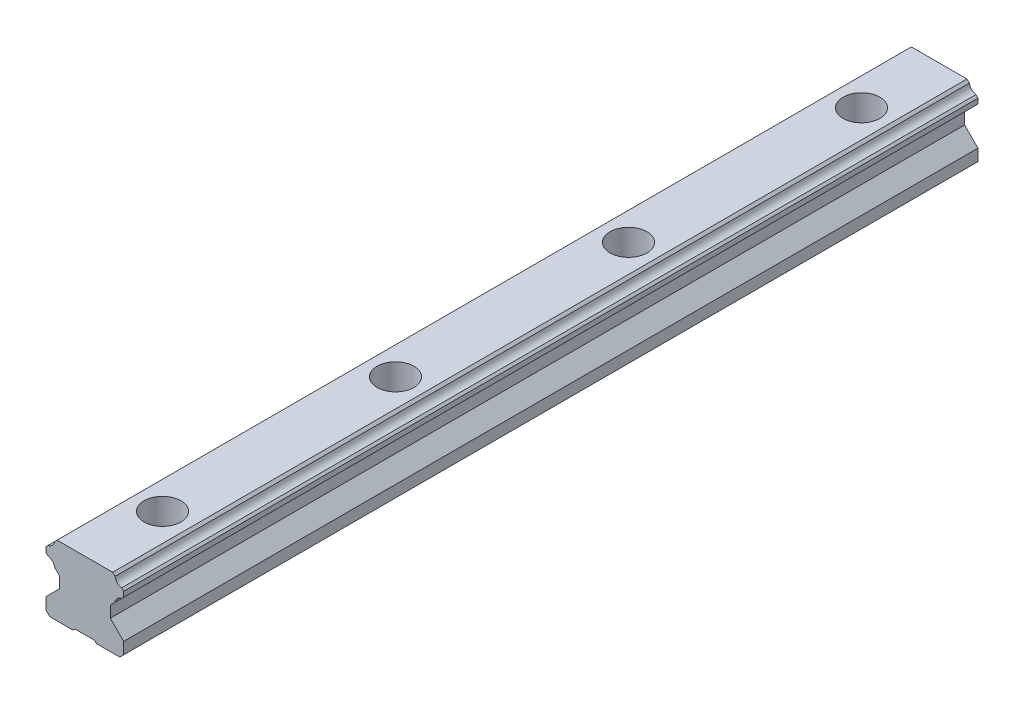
ISO-10303-21;
HEADER;
FILE_DESCRIPTION(('STEP AP214'),'2;1');
FILE_NAME('part.step','',(''),(''),'','','');
FILE_SCHEMA(('AUTOMOTIVE_DESIGN { 1 0 10303 214 1 1 1 1 }'));
ENDSEC;
DATA;
#1=APPLICATION_CONTEXT('core data for automotive mechanical design processes');
#2=APPLICATION_PROTOCOL_DEFINITION('international standard','automotive_design',2000,#1);
#3=PRODUCT_CONTEXT('',#1,'mechanical');
#4=PRODUCT('Part','Part','',(#3));
#5=PRODUCT_RELATED_PRODUCT_CATEGORY('part','',(#4));
#6=PRODUCT_DEFINITION_FORMATION('','',#4);
#7=PRODUCT_DEFINITION_CONTEXT('part definition',#1,'design');
#8=PRODUCT_DEFINITION('design','',#6,#7);
#9=PRODUCT_DEFINITION_SHAPE('','',#8);
#10=(LENGTH_UNIT() NAMED_UNIT(*) SI_UNIT(.MILLI.,.METRE.));
#11=(NAMED_UNIT(*) PLANE_ANGLE_UNIT() SI_UNIT($,.RADIAN.));
#12=(NAMED_UNIT(*) SI_UNIT($,.STERADIAN.) SOLID_ANGLE_UNIT());
#13=UNCERTAINTY_MEASURE_WITH_UNIT(LENGTH_MEASURE(1.E-05),#10,'distance_accuracy_value','');
#14=(GEOMETRIC_REPRESENTATION_CONTEXT(3) GLOBAL_UNCERTAINTY_ASSIGNED_CONTEXT((#13)) GLOBAL_UNIT_ASSIGNED_CONTEXT((#10,
#11,#12)) REPRESENTATION_CONTEXT('',''));
#15=CARTESIAN_POINT('',(0.,0.,0.));
#16=DIRECTION('',(0.,0.,1.));
#17=DIRECTION('',(1.,0.,0.));
#18=AXIS2_PLACEMENT_3D('',#15,#16,#17);
#19=CARTESIAN_POINT('',(-2.5,0.5,110.));
#20=DIRECTION('',(0.,1.,0.));
#21=DIRECTION('',(0.,0.,1.));
#22=AXIS2_PLACEMENT_3D('',#19,#20,#21);
#23=PLANE('',#22);
#24=DIRECTION('',(0.,0.,-1.));
#25=VECTOR('',#24,1.);
#26=CARTESIAN_POINT('',(2.5,0.5,110.));
#27=LINE('',#26,#25);
#28=CARTESIAN_POINT('',(2.5,0.5,-91.6583123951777));
#29=VERTEX_POINT('',#28);
#30=CARTESIAN_POINT('',(2.5,0.5,-110.));
#31=VERTEX_POINT('',#30);
#32=EDGE_CURVE('E327',#29,#31,#27,.T.);
#33=ORIENTED_EDGE('',*,*,#32,.F.);
#34=CARTESIAN_POINT('',(0.,0.5,-90.));
#35=DIRECTION('',(0.,1.,0.));
#36=DIRECTION('',(0.,0.,1.));
#37=AXIS2_PLACEMENT_3D('',#34,#35,#36);
#38=CIRCLE('',#37,3.);
#39=CARTESIAN_POINT('',(-2.5,0.5,-91.6583123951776));
#40=VERTEX_POINT('',#39);
#41=EDGE_CURVE('E295',#29,#40,#38,.T.);
#42=ORIENTED_EDGE('',*,*,#41,.T.);
#43=DIRECTION('',(0.,0.,-1.));
#44=VECTOR('',#43,1.);
#45=CARTESIAN_POINT('',(-2.5,0.5,110.));
#46=LINE('',#45,#44);
#47=CARTESIAN_POINT('',(-2.5,0.5,-110.));
#48=VERTEX_POINT('',#47);
#49=EDGE_CURVE('E332',#40,#48,#46,.T.);
#50=ORIENTED_EDGE('',*,*,#49,.T.);
#51=DIRECTION('',(1.,0.,0.));
#52=VECTOR('',#51,1.);
#53=CARTESIAN_POINT('',(-2.5,0.5,-110.));
#54=LINE('',#53,#52);
#55=EDGE_CURVE('E390',#48,#31,#54,.T.);
#56=ORIENTED_EDGE('',*,*,#55,.T.);
#57=EDGE_LOOP('',(#33,#42,#50,#56));
#58=FACE_BOUND('',#57,.T.);
#59=ADVANCED_FACE('F35',(#58),#23,.F.);
#60=CARTESIAN_POINT('',(-2.5,0.5,110.));
#61=DIRECTION('',(-0.707106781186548,0.707106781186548,0.));
#62=DIRECTION('',(-0.707106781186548,-0.707106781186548,0.));
#63=AXIS2_PLACEMENT_3D('',#60,#61,#62);
#64=PLANE('',#63);
#65=ORIENTED_EDGE('',*,*,#49,.F.);
#66=CARTESIAN_POINT('',(0.,3.,-90.));
#67=DIRECTION('',(-0.707106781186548,0.707106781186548,0.));
#68=DIRECTION('',(0.707106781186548,0.707106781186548,0.));
#69=AXIS2_PLACEMENT_3D('',#66,#67,#68);
#70=ELLIPSE('',#69,4.24264068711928,3.);
#71=CARTESIAN_POINT('',(-3.,0.,-90.));
#72=VERTEX_POINT('',#71);
#73=EDGE_CURVE('E11',#40,#72,#70,.T.);
#74=ORIENTED_EDGE('',*,*,#73,.T.);
#75=DIRECTION('',(0.,0.,-1.));
#76=VECTOR('',#75,1.);
#77=CARTESIAN_POINT('',(-3.,0.,110.));
#78=LINE('',#77,#76);
#79=CARTESIAN_POINT('',(-3.,0.,-110.));
#80=VERTEX_POINT('',#79);
#81=EDGE_CURVE('E337',#72,#80,#78,.T.);
#82=ORIENTED_EDGE('',*,*,#81,.T.);
#83=DIRECTION('',(0.707106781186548,0.707106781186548,0.));
#84=VECTOR('',#83,1.);
#85=CARTESIAN_POINT('',(-2.5,0.5,-110.));
#86=LINE('',#85,#84);
#87=EDGE_CURVE('E393',#80,#48,#86,.T.);
#88=ORIENTED_EDGE('',*,*,#87,.T.);
#89=EDGE_LOOP('',(#65,#74,#82,#88));
#90=FACE_BOUND('',#89,.T.);
#91=ADVANCED_FACE('F394',(#90),#64,.F.);
#92=CARTESIAN_POINT('',(3.,0.,110.));
#93=DIRECTION('',(0.707106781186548,0.707106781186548,0.));
#94=DIRECTION('',(-0.707106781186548,0.707106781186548,0.));
#95=AXIS2_PLACEMENT_3D('',#92,#93,#94);
#96=PLANE('',#95);
#97=CARTESIAN_POINT('',(2.5,0.5,-31.6583123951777));
#98=VERTEX_POINT('',#97);
#99=CARTESIAN_POINT('',(2.5,0.5,-88.3416876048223));
#100=VERTEX_POINT('',#99);
#101=EDGE_CURVE('E308',#98,#100,#27,.T.);
#102=ORIENTED_EDGE('',*,*,#101,.T.);
#103=CARTESIAN_POINT('',(0.,3.,-90.));
#104=DIRECTION('',(0.707106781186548,0.707106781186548,0.));
#105=DIRECTION('',(-0.707106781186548,0.707106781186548,0.));
#106=AXIS2_PLACEMENT_3D('',#103,#104,#105);
#107=ELLIPSE('',#106,4.24264068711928,3.);
#108=CARTESIAN_POINT('',(3.,0.,-90.));
#109=VERTEX_POINT('',#108);
#110=EDGE_CURVE('E293',#100,#109,#107,.T.);
#111=ORIENTED_EDGE('',*,*,#110,.T.);
#112=DIRECTION('',(0.,0.,-1.));
#113=VECTOR('',#112,1.);
#114=CARTESIAN_POINT('',(3.,0.,110.));
#115=LINE('',#114,#113);
#116=CARTESIAN_POINT('',(3.,0.,-30.));
#117=VERTEX_POINT('',#116);
#118=EDGE_CURVE('E305',#117,#109,#115,.T.);
#119=ORIENTED_EDGE('',*,*,#118,.F.);
#120=CARTESIAN_POINT('',(0.,3.,-30.));
#121=DIRECTION('',(0.707106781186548,0.707106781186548,0.));
#122=DIRECTION('',(-0.707106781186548,0.707106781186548,0.));
#123=AXIS2_PLACEMENT_3D('',#120,#121,#122);
#124=ELLIPSE('',#123,4.24264068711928,3.);
#125=EDGE_CURVE('E720',#117,#98,#124,.T.);
#126=ORIENTED_EDGE('',*,*,#125,.T.);
#127=EDGE_LOOP('',(#102,#111,#119,#126));
#128=FACE_BOUND('',#127,.T.);
#129=ADVANCED_FACE('F303',(#128),#96,.F.);
#130=CARTESIAN_POINT('',(-2.5,0.5,-31.6583123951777));
#131=VERTEX_POINT('',#130);
#132=CARTESIAN_POINT('',(-2.5,0.5,-88.3416876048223));
#133=VERTEX_POINT('',#132);
#134=EDGE_CURVE('E381',#131,#133,#46,.T.);
#135=ORIENTED_EDGE('',*,*,#134,.T.);
#136=EDGE_CURVE('E50',#133,#100,#38,.T.);
#137=ORIENTED_EDGE('',*,*,#136,.T.);
#138=ORIENTED_EDGE('',*,*,#101,.F.);
#139=CARTESIAN_POINT('',(0.,0.5,-30.));
#140=DIRECTION('',(0.,1.,0.));
#141=DIRECTION('',(0.,0.,1.));
#142=AXIS2_PLACEMENT_3D('',#139,#140,#141);
#143=CIRCLE('',#142,3.);
#144=EDGE_CURVE('E58',#98,#131,#143,.T.);
#145=ORIENTED_EDGE('',*,*,#144,.T.);
#146=EDGE_LOOP('',(#135,#137,#138,#145));
#147=FACE_BOUND('',#146,.T.);
#148=ADVANCED_FACE('F775',(#147),#23,.F.);
#149=CARTESIAN_POINT('',(-3.,0.,-30.));
#150=VERTEX_POINT('',#149);
#151=EDGE_CURVE('E1243',#150,#72,#78,.T.);
#152=ORIENTED_EDGE('',*,*,#151,.T.);
#153=EDGE_CURVE('E39',#72,#133,#70,.T.);
#154=ORIENTED_EDGE('',*,*,#153,.T.);
#155=ORIENTED_EDGE('',*,*,#134,.F.);
#156=CARTESIAN_POINT('',(0.,3.,-30.));
#157=DIRECTION('',(-0.707106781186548,0.707106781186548,0.));
#158=DIRECTION('',(0.707106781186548,0.707106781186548,0.));
#159=AXIS2_PLACEMENT_3D('',#156,#157,#158);
#160=ELLIPSE('',#159,4.24264068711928,3.);
#161=EDGE_CURVE('E728',#131,#150,#160,.T.);
#162=ORIENTED_EDGE('',*,*,#161,.T.);
#163=EDGE_LOOP('',(#152,#154,#155,#162));
#164=FACE_BOUND('',#163,.T.);
#165=ADVANCED_FACE('F786',(#164),#64,.F.);
#166=CARTESIAN_POINT('',(2.5,0.5,28.3416876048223));
#167=VERTEX_POINT('',#166);
#168=CARTESIAN_POINT('',(2.5,0.5,-28.3416876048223));
#169=VERTEX_POINT('',#168);
#170=EDGE_CURVE('E370',#167,#169,#27,.T.);
#171=ORIENTED_EDGE('',*,*,#170,.T.);
#172=EDGE_CURVE('E718',#169,#117,#124,.T.);
#173=ORIENTED_EDGE('',*,*,#172,.T.);
#174=CARTESIAN_POINT('',(3.,0.,30.));
#175=VERTEX_POINT('',#174);
#176=EDGE_CURVE('E322',#175,#117,#115,.T.);
#177=ORIENTED_EDGE('',*,*,#176,.F.);
#178=CARTESIAN_POINT('',(0.,3.,30.));
#179=DIRECTION('',(0.707106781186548,0.707106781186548,0.));
#180=DIRECTION('',(-0.707106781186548,0.707106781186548,0.));
#181=AXIS2_PLACEMENT_3D('',#178,#179,#180);
#182=ELLIPSE('',#181,4.24264068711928,3.);
#183=EDGE_CURVE('E714',#175,#167,#182,.T.);
#184=ORIENTED_EDGE('',*,*,#183,.T.);
#185=EDGE_LOOP('',(#171,#173,#177,#184));
#186=FACE_BOUND('',#185,.T.);
#187=ADVANCED_FACE('F717',(#186),#96,.F.);
#188=CARTESIAN_POINT('',(-3.,0.,30.));
#189=VERTEX_POINT('',#188);
#190=EDGE_CURVE('E761',#189,#150,#78,.T.);
#191=ORIENTED_EDGE('',*,*,#190,.T.);
#192=CARTESIAN_POINT('',(-2.5,0.5,-28.3416876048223));
#193=VERTEX_POINT('',#192);
#194=EDGE_CURVE('E380',#150,#193,#160,.T.);
#195=ORIENTED_EDGE('',*,*,#194,.T.);
#196=CARTESIAN_POINT('',(-2.5,0.5,28.3416876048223));
#197=VERTEX_POINT('',#196);
#198=EDGE_CURVE('E368',#197,#193,#46,.T.);
#199=ORIENTED_EDGE('',*,*,#198,.F.);
#200=CARTESIAN_POINT('',(0.,3.,30.));
#201=DIRECTION('',(-0.707106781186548,0.707106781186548,0.));
#202=DIRECTION('',(0.707106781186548,0.707106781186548,0.));
#203=AXIS2_PLACEMENT_3D('',#200,#201,#202);
#204=ELLIPSE('',#203,4.24264068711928,3.);
#205=EDGE_CURVE('E378',#197,#189,#204,.T.);
#206=ORIENTED_EDGE('',*,*,#205,.T.);
#207=EDGE_LOOP('',(#191,#195,#199,#206));
#208=FACE_BOUND('',#207,.T.);
#209=ADVANCED_FACE('F377',(#208),#64,.F.);
#210=CARTESIAN_POINT('',(2.5,0.5,88.3416876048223));
#211=VERTEX_POINT('',#210);
#212=CARTESIAN_POINT('',(2.5,0.5,31.6583123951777));
#213=VERTEX_POINT('',#212);
#214=EDGE_CURVE('E333',#211,#213,#27,.T.);
#215=ORIENTED_EDGE('',*,*,#214,.T.);
#216=EDGE_CURVE('E710',#213,#175,#182,.T.);
#217=ORIENTED_EDGE('',*,*,#216,.T.);
#218=CARTESIAN_POINT('',(3.,0.,90.));
#219=VERTEX_POINT('',#218);
#220=EDGE_CURVE('E323',#219,#175,#115,.T.);
#221=ORIENTED_EDGE('',*,*,#220,.F.);
#222=CARTESIAN_POINT('',(0.,3.,90.));
#223=DIRECTION('',(0.707106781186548,0.707106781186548,0.));
#224=DIRECTION('',(-0.707106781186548,0.707106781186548,0.));
#225=AXIS2_PLACEMENT_3D('',#222,#223,#224);
#226=ELLIPSE('',#225,4.24264068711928,3.);
#227=EDGE_CURVE('E704',#219,#211,#226,.T.);
#228=ORIENTED_EDGE('',*,*,#227,.T.);
#229=EDGE_LOOP('',(#215,#217,#221,#228));
#230=FACE_BOUND('',#229,.T.);
#231=ADVANCED_FACE('F709',(#230),#96,.F.);
#232=ORIENTED_EDGE('',*,*,#198,.T.);
#233=EDGE_CURVE('E719',#193,#169,#143,.T.);
#234=ORIENTED_EDGE('',*,*,#233,.T.);
#235=ORIENTED_EDGE('',*,*,#170,.F.);
#236=CARTESIAN_POINT('',(0.,0.5,30.));
#237=DIRECTION('',(0.,1.,0.));
#238=DIRECTION('',(0.,0.,1.));
#239=AXIS2_PLACEMENT_3D('',#236,#237,#238);
#240=CIRCLE('',#239,3.);
#241=EDGE_CURVE('E299',#167,#197,#240,.T.);
#242=ORIENTED_EDGE('',*,*,#241,.T.);
#243=EDGE_LOOP('',(#232,#234,#235,#242));
#244=FACE_BOUND('',#243,.T.);
#245=ADVANCED_FACE('F366',(#244),#23,.F.);
#246=CARTESIAN_POINT('',(-3.,0.,90.));
#247=VERTEX_POINT('',#246);
#248=EDGE_CURVE('E343',#247,#189,#78,.T.);
#249=ORIENTED_EDGE('',*,*,#248,.T.);
#250=CARTESIAN_POINT('',(-2.5,0.5,31.6583123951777));
#251=VERTEX_POINT('',#250);
#252=EDGE_CURVE('E711',#189,#251,#204,.T.);
#253=ORIENTED_EDGE('',*,*,#252,.T.);
#254=CARTESIAN_POINT('',(-2.5,0.5,88.3416876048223));
#255=VERTEX_POINT('',#254);
#256=EDGE_CURVE('E338',#255,#251,#46,.T.);
#257=ORIENTED_EDGE('',*,*,#256,.F.);
#258=CARTESIAN_POINT('',(0.,3.,90.));
#259=DIRECTION('',(-0.707106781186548,0.707106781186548,0.));
#260=DIRECTION('',(0.707106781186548,0.707106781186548,0.));
#261=AXIS2_PLACEMENT_3D('',#258,#259,#260);
#262=ELLIPSE('',#261,4.24264068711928,3.);
#263=EDGE_CURVE('E567',#255,#247,#262,.T.);
#264=ORIENTED_EDGE('',*,*,#263,.T.);
#265=EDGE_LOOP('',(#249,#253,#257,#264));
#266=FACE_BOUND('',#265,.T.);
#267=ADVANCED_FACE('F758',(#266),#64,.F.);
#268=ORIENTED_EDGE('',*,*,#256,.T.);
#269=EDGE_CURVE('E355',#251,#213,#240,.T.);
#270=ORIENTED_EDGE('',*,*,#269,.T.);
#271=ORIENTED_EDGE('',*,*,#214,.F.);
#272=CARTESIAN_POINT('',(0.,0.5,90.));
#273=DIRECTION('',(0.,1.,0.));
#274=DIRECTION('',(0.,0.,1.));
#275=AXIS2_PLACEMENT_3D('',#272,#273,#274);
#276=CIRCLE('',#275,3.);
#277=EDGE_CURVE('E747',#211,#255,#276,.T.);
#278=ORIENTED_EDGE('',*,*,#277,.T.);
#279=EDGE_LOOP('',(#268,#270,#271,#278));
#280=FACE_BOUND('',#279,.T.);
#281=ADVANCED_FACE('F767',(#280),#23,.F.);
#282=CARTESIAN_POINT('',(2.5,0.5,110.));
#283=VERTEX_POINT('',#282);
#284=CARTESIAN_POINT('',(2.5,0.5,91.6583123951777));
#285=VERTEX_POINT('',#284);
#286=EDGE_CURVE('E329',#283,#285,#27,.T.);
#287=ORIENTED_EDGE('',*,*,#286,.T.);
#288=EDGE_CURVE('E699',#285,#219,#226,.T.);
#289=ORIENTED_EDGE('',*,*,#288,.T.);
#290=CARTESIAN_POINT('',(3.,0.,110.));
#291=VERTEX_POINT('',#290);
#292=EDGE_CURVE('E318',#291,#219,#115,.T.);
#293=ORIENTED_EDGE('',*,*,#292,.F.);
#294=DIRECTION('',(0.707106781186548,-0.707106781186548,0.));
#295=VECTOR('',#294,1.);
#296=CARTESIAN_POINT('',(3.,0.,110.));
#297=LINE('',#296,#295);
#298=EDGE_CURVE('E690',#283,#291,#297,.T.);
#299=ORIENTED_EDGE('',*,*,#298,.F.);
#300=EDGE_LOOP('',(#287,#289,#293,#299));
#301=FACE_BOUND('',#300,.T.);
#302=ADVANCED_FACE('F698',(#301),#96,.F.);
#303=CARTESIAN_POINT('',(-6.5500488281,10.3792352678,110.));
#304=DIRECTION('',(1.,0.,0.));
#305=DIRECTION('',(0.,0.,-1.));
#306=AXIS2_PLACEMENT_3D('',#303,#304,#305);
#307=PLANE('',#306);
#308=DIRECTION('',(0.,-1.,0.));
#309=VECTOR('',#308,1.);
#310=CARTESIAN_POINT('',(-6.5500488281,10.3792352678,-110.));
#311=LINE('',#310,#309);
#312=CARTESIAN_POINT('',(-6.5500488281,10.3792352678,-110.));
#313=VERTEX_POINT('',#312);
#314=CARTESIAN_POINT('',(-6.5500488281,7.4499511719,-110.));
#315=VERTEX_POINT('',#314);
#316=EDGE_CURVE('E563',#313,#315,#311,.T.);
#317=ORIENTED_EDGE('',*,*,#316,.T.);
#318=DIRECTION('',(0.,0.,-1.));
#319=VECTOR('',#318,1.);
#320=CARTESIAN_POINT('',(-6.5500488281,7.4499511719,110.));
#321=LINE('',#320,#319);
#322=CARTESIAN_POINT('',(-6.5500488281,7.4499511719,110.));
#323=VERTEX_POINT('',#322);
#324=EDGE_CURVE('E352',#323,#315,#321,.T.);
#325=ORIENTED_EDGE('',*,*,#324,.F.);
#326=DIRECTION('',(0.,-1.,0.));
#327=VECTOR('',#326,1.);
#328=CARTESIAN_POINT('',(-6.5500488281,10.3792352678,110.));
#329=LINE('',#328,#327);
#330=CARTESIAN_POINT('',(-6.5500488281,10.3792352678,110.));
#331=VERTEX_POINT('',#330);
#332=EDGE_CURVE('E447',#331,#323,#329,.T.);
#333=ORIENTED_EDGE('',*,*,#332,.F.);
#334=DIRECTION('',(0.,0.,-1.));
#335=VECTOR('',#334,1.);
#336=CARTESIAN_POINT('',(-6.5500488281,10.3792352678,110.));
#337=LINE('',#336,#335);
#338=EDGE_CURVE('E448',#331,#313,#337,.T.);
#339=ORIENTED_EDGE('',*,*,#338,.T.);
#340=EDGE_LOOP('',(#317,#325,#333,#339));
#341=FACE_BOUND('',#340,.T.);
#342=ADVANCED_FACE('F37',(#341),#307,.F.);
#343=CARTESIAN_POINT('',(-6.5500488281,7.4499511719,110.));
#344=DIRECTION('',(0.707098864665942,-0.707114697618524,0.));
#345=DIRECTION('',(0.707114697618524,0.707098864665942,0.));
#346=AXIS2_PLACEMENT_3D('',#343,#344,#345);
#347=PLANE('',#346);
#348=DIRECTION('',(-0.707114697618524,-0.707098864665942,0.));
#349=VECTOR('',#348,1.);
#350=CARTESIAN_POINT('',(-6.5500488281,7.4499511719,-110.));
#351=LINE('',#350,#349);
#352=CARTESIAN_POINT('',(-10.,4.0000772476,-110.));
#353=VERTEX_POINT('',#352);
#354=EDGE_CURVE('E566',#315,#353,#351,.T.);
#355=ORIENTED_EDGE('',*,*,#354,.T.);
#356=DIRECTION('',(0.,0.,-1.));
#357=VECTOR('',#356,1.);
#358=CARTESIAN_POINT('',(-10.,4.0000772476,110.));
#359=LINE('',#358,#357);
#360=CARTESIAN_POINT('',(-10.,4.0000772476,110.));
#361=VERTEX_POINT('',#360);
#362=EDGE_CURVE('E349',#361,#353,#359,.T.);
#363=ORIENTED_EDGE('',*,*,#362,.F.);
#364=DIRECTION('',(-0.707114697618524,-0.707098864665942,0.));
#365=VECTOR('',#364,1.);
#366=CARTESIAN_POINT('',(-6.5500488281,7.4499511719,110.));
#367=LINE('',#366,#365);
#368=EDGE_CURVE('E592',#323,#361,#367,.T.);
#369=ORIENTED_EDGE('',*,*,#368,.F.);
#370=ORIENTED_EDGE('',*,*,#324,.T.);
#371=EDGE_LOOP('',(#355,#363,#369,#370));
#372=FACE_BOUND('',#371,.T.);
#373=ADVANCED_FACE('F591',(#372),#347,.F.);
#374=CARTESIAN_POINT('',(-10.,4.0000772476,110.));
#375=DIRECTION('',(1.,0.,0.));
#376=DIRECTION('',(0.,0.,-1.));
#377=AXIS2_PLACEMENT_3D('',#374,#375,#376);
#378=PLANE('',#377);
#379=DIRECTION('',(0.,-1.,0.));
#380=VECTOR('',#379,1.);
#381=CARTESIAN_POINT('',(-10.,4.0000772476,-110.));
#382=LINE('',#381,#380);
#383=CARTESIAN_POINT('',(-10.,1.,-110.));
#384=VERTEX_POINT('',#383);
#385=EDGE_CURVE('E569',#353,#384,#382,.T.);
#386=ORIENTED_EDGE('',*,*,#385,.T.);
#387=DIRECTION('',(0.,0.,-1.));
#388=VECTOR('',#387,1.);
#389=CARTESIAN_POINT('',(-10.,1.,110.));
#390=LINE('',#389,#388);
#391=CARTESIAN_POINT('',(-10.,1.,110.));
#392=VERTEX_POINT('',#391);
#393=EDGE_CURVE('E346',#392,#384,#390,.T.);
#394=ORIENTED_EDGE('',*,*,#393,.F.);
#395=DIRECTION('',(0.,-1.,0.));
#396=VECTOR('',#395,1.);
#397=CARTESIAN_POINT('',(-10.,4.0000772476,110.));
#398=LINE('',#397,#396);
#399=EDGE_CURVE('E588',#361,#392,#398,.T.);
#400=ORIENTED_EDGE('',*,*,#399,.F.);
#401=ORIENTED_EDGE('',*,*,#362,.T.);
#402=EDGE_LOOP('',(#386,#394,#400,#401));
#403=FACE_BOUND('',#402,.T.);
#404=ADVANCED_FACE('F587',(#403),#378,.F.);
#405=CARTESIAN_POINT('',(-9.,0.,110.));
#406=DIRECTION('',(0.707106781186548,0.707106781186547,0.));
#407=DIRECTION('',(-0.707106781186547,0.707106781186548,0.));
#408=AXIS2_PLACEMENT_3D('',#405,#406,#407);
#409=PLANE('',#408);
#410=DIRECTION('',(0.707106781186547,-0.707106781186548,0.));
#411=VECTOR('',#410,1.);
#412=CARTESIAN_POINT('',(-9.,0.,-110.));
#413=LINE('',#412,#411);
#414=CARTESIAN_POINT('',(-9.,0.,-110.));
#415=VERTEX_POINT('',#414);
#416=EDGE_CURVE('E571',#384,#415,#413,.T.);
#417=ORIENTED_EDGE('',*,*,#416,.T.);
#418=DIRECTION('',(0.,0.,-1.));
#419=VECTOR('',#418,1.);
#420=CARTESIAN_POINT('',(-9.,0.,110.));
#421=LINE('',#420,#419);
#422=CARTESIAN_POINT('',(-9.,0.,110.));
#423=VERTEX_POINT('',#422);
#424=EDGE_CURVE('E342',#423,#415,#421,.T.);
#425=ORIENTED_EDGE('',*,*,#424,.F.);
#426=DIRECTION('',(0.707106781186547,-0.707106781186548,0.));
#427=VECTOR('',#426,1.);
#428=CARTESIAN_POINT('',(-9.,0.,110.));
#429=LINE('',#428,#427);
#430=EDGE_CURVE('E584',#392,#423,#429,.T.);
#431=ORIENTED_EDGE('',*,*,#430,.F.);
#432=ORIENTED_EDGE('',*,*,#393,.T.);
#433=EDGE_LOOP('',(#417,#425,#431,#432));
#434=FACE_BOUND('',#433,.T.);
#435=ADVANCED_FACE('F581',(#434),#409,.F.);
#436=CARTESIAN_POINT('',(-9.,0.,110.));
#437=DIRECTION('',(0.,1.,0.));
#438=DIRECTION('',(0.,0.,1.));
#439=AXIS2_PLACEMENT_3D('',#436,#437,#438);
#440=PLANE('',#439);
#441=DIRECTION('',(1.,0.,0.));
#442=VECTOR('',#441,1.);
#443=CARTESIAN_POINT('',(-9.,0.,-110.));
#444=LINE('',#443,#442);
#445=EDGE_CURVE('E399',#415,#80,#444,.T.);
#446=ORIENTED_EDGE('',*,*,#445,.T.);
#447=ORIENTED_EDGE('',*,*,#81,.F.);
#448=ORIENTED_EDGE('',*,*,#151,.F.);
#449=ORIENTED_EDGE('',*,*,#190,.F.);
#450=ORIENTED_EDGE('',*,*,#248,.F.);
#451=CARTESIAN_POINT('',(-3.,0.,110.));
#452=VERTEX_POINT('',#451);
#453=EDGE_CURVE('E339',#452,#247,#78,.T.);
#454=ORIENTED_EDGE('',*,*,#453,.F.);
#455=DIRECTION('',(1.,0.,0.));
#456=VECTOR('',#455,1.);
#457=CARTESIAN_POINT('',(-9.,0.,110.));
#458=LINE('',#457,#456);
#459=EDGE_CURVE('E684',#423,#452,#458,.T.);
#460=ORIENTED_EDGE('',*,*,#459,.F.);
#461=ORIENTED_EDGE('',*,*,#424,.T.);
#462=EDGE_LOOP('',(#446,#447,#448,#449,#450,#454,#460,#461));
#463=FACE_BOUND('',#462,.T.);
#464=ADVANCED_FACE('F573',(#463),#440,.F.);
#465=ORIENTED_EDGE('',*,*,#453,.T.);
#466=CARTESIAN_POINT('',(-2.5,0.5,91.6583123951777));
#467=VERTEX_POINT('',#466);
#468=EDGE_CURVE('E679',#247,#467,#262,.T.);
#469=ORIENTED_EDGE('',*,*,#468,.T.);
#470=CARTESIAN_POINT('',(-2.5,0.5,110.));
#471=VERTEX_POINT('',#470);
#472=EDGE_CURVE('E334',#471,#467,#46,.T.);
#473=ORIENTED_EDGE('',*,*,#472,.F.);
#474=DIRECTION('',(0.707106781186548,0.707106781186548,0.));
#475=VECTOR('',#474,1.);
#476=CARTESIAN_POINT('',(-2.5,0.5,110.));
#477=LINE('',#476,#475);
#478=EDGE_CURVE('E686',#452,#471,#477,.T.);
#479=ORIENTED_EDGE('',*,*,#478,.F.);
#480=EDGE_LOOP('',(#465,#469,#473,#479));
#481=FACE_BOUND('',#480,.T.);
#482=ADVANCED_FACE('F762',(#481),#64,.F.);
#483=ORIENTED_EDGE('',*,*,#472,.T.);
#484=EDGE_CURVE('E703',#467,#285,#276,.T.);
#485=ORIENTED_EDGE('',*,*,#484,.T.);
#486=ORIENTED_EDGE('',*,*,#286,.F.);
#487=DIRECTION('',(1.,0.,0.));
#488=VECTOR('',#487,1.);
#489=CARTESIAN_POINT('',(-2.5,0.5,110.));
#490=LINE('',#489,#488);
#491=EDGE_CURVE('E688',#471,#283,#490,.T.);
#492=ORIENTED_EDGE('',*,*,#491,.F.);
#493=EDGE_LOOP('',(#483,#485,#486,#492));
#494=FACE_BOUND('',#493,.T.);
#495=ADVANCED_FACE('F764',(#494),#23,.F.);
#496=CARTESIAN_POINT('',(3.,0.,-110.));
#497=VERTEX_POINT('',#496);
#498=EDGE_CURVE('E310',#109,#497,#115,.T.);
#499=ORIENTED_EDGE('',*,*,#498,.F.);
#500=EDGE_CURVE('E290',#109,#29,#107,.T.);
#501=ORIENTED_EDGE('',*,*,#500,.T.);
#502=ORIENTED_EDGE('',*,*,#32,.T.);
#503=DIRECTION('',(0.707106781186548,-0.707106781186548,0.));
#504=VECTOR('',#503,1.);
#505=CARTESIAN_POINT('',(3.,0.,-110.));
#506=LINE('',#505,#504);
#507=EDGE_CURVE('E313',#31,#497,#506,.T.);
#508=ORIENTED_EDGE('',*,*,#507,.T.);
#509=EDGE_LOOP('',(#499,#501,#502,#508));
#510=FACE_BOUND('',#509,.T.);
#511=ADVANCED_FACE('F311',(#510),#96,.F.);
#512=CARTESIAN_POINT('',(3.,0.,110.));
#513=DIRECTION('',(0.,1.,0.));
#514=DIRECTION('',(0.,0.,1.));
#515=AXIS2_PLACEMENT_3D('',#512,#513,#514);
#516=PLANE('',#515);
#517=DIRECTION('',(1.,0.,0.));
#518=VECTOR('',#517,1.);
#519=CARTESIAN_POINT('',(3.,0.,-110.));
#520=LINE('',#519,#518);
#521=CARTESIAN_POINT('',(9.,0.,-110.));
#522=VERTEX_POINT('',#521);
#523=EDGE_CURVE('E404',#497,#522,#520,.T.);
#524=ORIENTED_EDGE('',*,*,#523,.T.);
#525=DIRECTION('',(0.,0.,-1.));
#526=VECTOR('',#525,1.);
#527=CARTESIAN_POINT('',(9.,0.,110.));
#528=LINE('',#527,#526);
#529=CARTESIAN_POINT('',(9.,0.,110.));
#530=VERTEX_POINT('',#529);
#531=EDGE_CURVE('E316',#530,#522,#528,.T.);
#532=ORIENTED_EDGE('',*,*,#531,.F.);
#533=DIRECTION('',(1.,0.,0.));
#534=VECTOR('',#533,1.);
#535=CARTESIAN_POINT('',(3.,0.,110.));
#536=LINE('',#535,#534);
#537=EDGE_CURVE('E692',#291,#530,#536,.T.);
#538=ORIENTED_EDGE('',*,*,#537,.F.);
#539=ORIENTED_EDGE('',*,*,#292,.T.);
#540=ORIENTED_EDGE('',*,*,#220,.T.);
#541=ORIENTED_EDGE('',*,*,#176,.T.);
#542=ORIENTED_EDGE('',*,*,#118,.T.);
#543=ORIENTED_EDGE('',*,*,#498,.T.);
#544=EDGE_LOOP('',(#524,#532,#538,#539,#540,#541,#542,#543));
#545=FACE_BOUND('',#544,.T.);
#546=ADVANCED_FACE('F319',(#545),#516,.F.);
#547=CARTESIAN_POINT('',(10.,1.,110.));
#548=DIRECTION('',(-0.707106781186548,0.707106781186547,0.));
#549=DIRECTION('',(-0.707106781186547,-0.707106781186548,0.));
#550=AXIS2_PLACEMENT_3D('',#547,#548,#549);
#551=PLANE('',#550);
#552=DIRECTION('',(0.707106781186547,0.707106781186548,0.));
#553=VECTOR('',#552,1.);
#554=CARTESIAN_POINT('',(10.,1.,-110.));
#555=LINE('',#554,#553);
#556=CARTESIAN_POINT('',(10.,1.,-110.));
#557=VERTEX_POINT('',#556);
#558=EDGE_CURVE('E409',#522,#557,#555,.T.);
#559=ORIENTED_EDGE('',*,*,#558,.T.);
#560=DIRECTION('',(0.,0.,-1.));
#561=VECTOR('',#560,1.);
#562=CARTESIAN_POINT('',(10.,1.,110.));
#563=LINE('',#562,#561);
#564=CARTESIAN_POINT('',(10.,1.,110.));
#565=VERTEX_POINT('',#564);
#566=EDGE_CURVE('E502',#565,#557,#563,.T.);
#567=ORIENTED_EDGE('',*,*,#566,.F.);
#568=DIRECTION('',(0.707106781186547,0.707106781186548,0.));
#569=VECTOR('',#568,1.);
#570=CARTESIAN_POINT('',(10.,1.,110.));
#571=LINE('',#570,#569);
#572=EDGE_CURVE('E514',#530,#565,#571,.T.);
#573=ORIENTED_EDGE('',*,*,#572,.F.);
#574=ORIENTED_EDGE('',*,*,#531,.T.);
#575=EDGE_LOOP('',(#559,#567,#573,#574));
#576=FACE_BOUND('',#575,.T.);
#577=ADVANCED_FACE('F513',(#576),#551,.F.);
#578=CARTESIAN_POINT('',(10.,1.,110.));
#579=DIRECTION('',(-1.,0.,0.));
#580=DIRECTION('',(0.,0.,1.));
#581=AXIS2_PLACEMENT_3D('',#578,#579,#580);
#582=PLANE('',#581);
#583=DIRECTION('',(0.,1.,0.));
#584=VECTOR('',#583,1.);
#585=CARTESIAN_POINT('',(10.,1.,-110.));
#586=LINE('',#585,#584);
#587=CARTESIAN_POINT('',(10.,4.0000772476,-110.));
#588=VERTEX_POINT('',#587);
#589=EDGE_CURVE('E411',#557,#588,#586,.T.);
#590=ORIENTED_EDGE('',*,*,#589,.T.);
#591=DIRECTION('',(0.,0.,-1.));
#592=VECTOR('',#591,1.);
#593=CARTESIAN_POINT('',(10.,4.0000772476,110.));
#594=LINE('',#593,#592);
#595=CARTESIAN_POINT('',(10.,4.0000772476,110.));
#596=VERTEX_POINT('',#595);
#597=EDGE_CURVE('E500',#596,#588,#594,.T.);
#598=ORIENTED_EDGE('',*,*,#597,.F.);
#599=DIRECTION('',(0.,1.,0.));
#600=VECTOR('',#599,1.);
#601=CARTESIAN_POINT('',(10.,1.,110.));
#602=LINE('',#601,#600);
#603=EDGE_CURVE('E528',#565,#596,#602,.T.);
#604=ORIENTED_EDGE('',*,*,#603,.F.);
#605=ORIENTED_EDGE('',*,*,#566,.T.);
#606=EDGE_LOOP('',(#590,#598,#604,#605));
#607=FACE_BOUND('',#606,.T.);
#608=ADVANCED_FACE('F519',(#607),#582,.F.);
#609=CARTESIAN_POINT('',(10.,4.0000772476,110.));
#610=DIRECTION('',(-0.707098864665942,-0.707114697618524,0.));
#611=DIRECTION('',(0.707114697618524,-0.707098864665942,0.));
#612=AXIS2_PLACEMENT_3D('',#609,#610,#611);
#613=PLANE('',#612);
#614=DIRECTION('',(-0.707114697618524,0.707098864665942,0.));
#615=VECTOR('',#614,1.);
#616=CARTESIAN_POINT('',(10.,4.0000772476,-110.));
#617=LINE('',#616,#615);
#618=CARTESIAN_POINT('',(6.5500488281,7.4499511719,-110.));
#619=VERTEX_POINT('',#618);
#620=EDGE_CURVE('E413',#588,#619,#617,.T.);
#621=ORIENTED_EDGE('',*,*,#620,.T.);
#622=DIRECTION('',(0.,0.,-1.));
#623=VECTOR('',#622,1.);
#624=CARTESIAN_POINT('',(6.5500488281,7.4499511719,110.));
#625=LINE('',#624,#623);
#626=CARTESIAN_POINT('',(6.5500488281,7.4499511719,110.));
#627=VERTEX_POINT('',#626);
#628=EDGE_CURVE('E497',#627,#619,#625,.T.);
#629=ORIENTED_EDGE('',*,*,#628,.F.);
#630=DIRECTION('',(-0.707114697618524,0.707098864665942,0.));
#631=VECTOR('',#630,1.);
#632=CARTESIAN_POINT('',(10.,4.0000772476,110.));
#633=LINE('',#632,#631);
#634=EDGE_CURVE('E524',#596,#627,#633,.T.);
#635=ORIENTED_EDGE('',*,*,#634,.F.);
#636=ORIENTED_EDGE('',*,*,#597,.T.);
#637=EDGE_LOOP('',(#621,#629,#635,#636));
#638=FACE_BOUND('',#637,.T.);
#639=ADVANCED_FACE('F522',(#638),#613,.F.);
#640=CARTESIAN_POINT('',(6.5500488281,7.4499511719,110.));
#641=DIRECTION('',(-1.,0.,0.));
#642=DIRECTION('',(0.,0.,1.));
#643=AXIS2_PLACEMENT_3D('',#640,#641,#642);
#644=PLANE('',#643);
#645=DIRECTION('',(0.,1.,0.));
#646=VECTOR('',#645,1.);
#647=CARTESIAN_POINT('',(6.5500488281,7.4499511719,-110.));
#648=LINE('',#647,#646);
#649=CARTESIAN_POINT('',(6.5500488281,10.3792352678,-110.));
#650=VERTEX_POINT('',#649);
#651=EDGE_CURVE('E415',#619,#650,#648,.T.);
#652=ORIENTED_EDGE('',*,*,#651,.T.);
#653=DIRECTION('',(0.,0.,-1.));
#654=VECTOR('',#653,1.);
#655=CARTESIAN_POINT('',(6.5500488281,10.3792352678,110.));
#656=LINE('',#655,#654);
#657=CARTESIAN_POINT('',(6.5500488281,10.3792352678,110.));
#658=VERTEX_POINT('',#657);
#659=EDGE_CURVE('E494',#658,#650,#656,.T.);
#660=ORIENTED_EDGE('',*,*,#659,.F.);
#661=DIRECTION('',(0.,1.,0.));
#662=VECTOR('',#661,1.);
#663=CARTESIAN_POINT('',(6.5500488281,7.4499511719,110.));
#664=LINE('',#663,#662);
#665=EDGE_CURVE('E527',#627,#658,#664,.T.);
#666=ORIENTED_EDGE('',*,*,#665,.F.);
#667=ORIENTED_EDGE('',*,*,#628,.T.);
#668=EDGE_LOOP('',(#652,#660,#666,#667));
#669=FACE_BOUND('',#668,.T.);
#670=ADVANCED_FACE('F674',(#669),#644,.F.);
#671=CARTESIAN_POINT('',(7.76594554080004,11.5951315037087,110.));
#672=DIRECTION('',(-0.707106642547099,0.707106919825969,0.));
#673=DIRECTION('',(-0.707106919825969,-0.707106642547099,0.));
#674=AXIS2_PLACEMENT_3D('',#671,#672,#673);
#675=PLANE('',#674);
#676=DIRECTION('',(0.707106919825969,0.707106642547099,0.));
#677=VECTOR('',#676,1.);
#678=CARTESIAN_POINT('',(7.76594554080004,11.5951315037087,-110.));
#679=LINE('',#678,#677);
#680=CARTESIAN_POINT('',(7.76594554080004,11.5951315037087,-110.));
#681=VERTEX_POINT('',#680);
#682=EDGE_CURVE('E417',#650,#681,#679,.T.);
#683=ORIENTED_EDGE('',*,*,#682,.T.);
#684=DIRECTION('',(0.,0.,-1.));
#685=VECTOR('',#684,1.);
#686=CARTESIAN_POINT('',(7.76594554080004,11.5951315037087,110.));
#687=LINE('',#686,#685);
#688=CARTESIAN_POINT('',(7.76594554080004,11.5951315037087,110.));
#689=VERTEX_POINT('',#688);
#690=EDGE_CURVE('E491',#689,#681,#687,.T.);
#691=ORIENTED_EDGE('',*,*,#690,.F.);
#692=DIRECTION('',(0.707106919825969,0.707106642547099,0.));
#693=VECTOR('',#692,1.);
#694=CARTESIAN_POINT('',(7.76594554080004,11.5951315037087,110.));
#695=LINE('',#694,#693);
#696=EDGE_CURVE('E530',#658,#689,#695,.T.);
#697=ORIENTED_EDGE('',*,*,#696,.F.);
#698=ORIENTED_EDGE('',*,*,#659,.T.);
#699=EDGE_LOOP('',(#683,#691,#697,#698));
#700=FACE_BOUND('',#699,.T.);
#701=ADVANCED_FACE('F670',(#700),#675,.F.);
#702=CARTESIAN_POINT('',(9.8015136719,11.2788085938,110.));
#703=DIRECTION('',(0.,0.,-1.));
#704=DIRECTION('',(-1.,0.,0.));
#705=AXIS2_PLACEMENT_3D('',#702,#703,#704);
#706=CYLINDRICAL_SURFACE('',#705,2.05999946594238);
#707=CARTESIAN_POINT('',(9.8015136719,11.2788085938,-110.));
#708=DIRECTION('',(0.,0.,-1.));
#709=DIRECTION('',(1.,0.,0.));
#710=AXIS2_PLACEMENT_3D('',#707,#708,#709);
#711=CIRCLE('',#710,2.05999946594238);
#712=CARTESIAN_POINT('',(9.48519019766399,13.3143766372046,-110.));
#713=VERTEX_POINT('',#712);
#714=EDGE_CURVE('E419',#681,#713,#711,.T.);
#715=ORIENTED_EDGE('',*,*,#714,.T.);
#716=DIRECTION('',(0.,0.,-1.));
#717=VECTOR('',#716,1.);
#718=CARTESIAN_POINT('',(9.48519019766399,13.3143766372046,110.));
#719=LINE('',#718,#717);
#720=CARTESIAN_POINT('',(9.48519019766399,13.3143766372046,110.));
#721=VERTEX_POINT('',#720);
#722=EDGE_CURVE('E488',#721,#713,#719,.T.);
#723=ORIENTED_EDGE('',*,*,#722,.F.);
#724=CARTESIAN_POINT('',(9.8015136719,11.2788085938,110.));
#725=DIRECTION('',(0.,0.,-1.));
#726=DIRECTION('',(1.,0.,0.));
#727=AXIS2_PLACEMENT_3D('',#724,#725,#726);
#728=CIRCLE('',#727,2.05999946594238);
#729=EDGE_CURVE('E536',#689,#721,#728,.T.);
#730=ORIENTED_EDGE('',*,*,#729,.F.);
#731=ORIENTED_EDGE('',*,*,#690,.T.);
#732=EDGE_LOOP('',(#715,#723,#730,#731));
#733=FACE_BOUND('',#732,.T.);
#734=ADVANCED_FACE('F666',(#733),#706,.F.);
#735=CARTESIAN_POINT('',(9.99999999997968,13.8291864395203,110.));
#736=DIRECTION('',(-0.707106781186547,0.707106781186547,0.));
#737=DIRECTION('',(-0.707106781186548,-0.707106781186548,0.));
#738=AXIS2_PLACEMENT_3D('',#735,#736,#737);
#739=PLANE('',#738);
#740=DIRECTION('',(0.707106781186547,0.707106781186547,0.));
#741=VECTOR('',#740,1.);
#742=CARTESIAN_POINT('',(9.99999999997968,13.8291864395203,-110.));
#743=LINE('',#742,#741);
#744=CARTESIAN_POINT('',(9.99999999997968,13.8291864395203,-110.));
#745=VERTEX_POINT('',#744);
#746=EDGE_CURVE('E421',#713,#745,#743,.T.);
#747=ORIENTED_EDGE('',*,*,#746,.T.);
#748=DIRECTION('',(0.,0.,-1.));
#749=VECTOR('',#748,1.);
#750=CARTESIAN_POINT('',(9.99999999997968,13.8291864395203,110.));
#751=LINE('',#750,#749);
#752=CARTESIAN_POINT('',(9.99999999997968,13.8291864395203,110.));
#753=VERTEX_POINT('',#752);
#754=EDGE_CURVE('E485',#753,#745,#751,.T.);
#755=ORIENTED_EDGE('',*,*,#754,.F.);
#756=DIRECTION('',(0.707106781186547,0.707106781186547,0.));
#757=VECTOR('',#756,1.);
#758=CARTESIAN_POINT('',(9.99999999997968,13.8291864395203,110.));
#759=LINE('',#758,#757);
#760=EDGE_CURVE('E538',#721,#753,#759,.T.);
#761=ORIENTED_EDGE('',*,*,#760,.F.);
#762=ORIENTED_EDGE('',*,*,#722,.T.);
#763=EDGE_LOOP('',(#747,#755,#761,#762));
#764=FACE_BOUND('',#763,.T.);
#765=ADVANCED_FACE('F662',(#764),#739,.F.);
#766=CARTESIAN_POINT('',(9.99999999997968,15.1600370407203,110.));
#767=DIRECTION('',(-1.,0.,0.));
#768=DIRECTION('',(0.,0.,1.));
#769=AXIS2_PLACEMENT_3D('',#766,#767,#768);
#770=PLANE('',#769);
#771=DIRECTION('',(0.,1.,0.));
#772=VECTOR('',#771,1.);
#773=CARTESIAN_POINT('',(9.99999999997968,15.1600370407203,-110.));
#774=LINE('',#773,#772);
#775=CARTESIAN_POINT('',(9.99999999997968,15.1600370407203,-110.));
#776=VERTEX_POINT('',#775);
#777=EDGE_CURVE('E423',#745,#776,#774,.T.);
#778=ORIENTED_EDGE('',*,*,#777,.T.);
#779=DIRECTION('',(0.,0.,-1.));
#780=VECTOR('',#779,1.);
#781=CARTESIAN_POINT('',(9.99999999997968,15.1600370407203,110.));
#782=LINE('',#781,#780);
#783=CARTESIAN_POINT('',(9.99999999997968,15.1600370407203,110.));
#784=VERTEX_POINT('',#783);
#785=EDGE_CURVE('E482',#784,#776,#782,.T.);
#786=ORIENTED_EDGE('',*,*,#785,.F.);
#787=DIRECTION('',(0.,1.,0.));
#788=VECTOR('',#787,1.);
#789=CARTESIAN_POINT('',(9.99999999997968,15.1600370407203,110.));
#790=LINE('',#789,#788);
#791=EDGE_CURVE('E540',#753,#784,#790,.T.);
#792=ORIENTED_EDGE('',*,*,#791,.F.);
#793=ORIENTED_EDGE('',*,*,#754,.T.);
#794=EDGE_LOOP('',(#778,#786,#792,#793));
#795=FACE_BOUND('',#794,.T.);
#796=ADVANCED_FACE('F657',(#795),#770,.F.);
#797=CARTESIAN_POINT('',(9.47267325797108,15.6873637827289,110.));
#798=DIRECTION('',(-0.707106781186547,-0.707106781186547,0.));
#799=DIRECTION('',(0.707106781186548,-0.707106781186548,0.));
#800=AXIS2_PLACEMENT_3D('',#797,#798,#799);
#801=PLANE('',#800);
#802=DIRECTION('',(-0.707106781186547,0.707106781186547,0.));
#803=VECTOR('',#802,1.);
#804=CARTESIAN_POINT('',(9.47267325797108,15.6873637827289,-110.));
#805=LINE('',#804,#803);
#806=CARTESIAN_POINT('',(9.47267325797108,15.6873637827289,-110.));
#807=VERTEX_POINT('',#806);
#808=EDGE_CURVE('E425',#776,#807,#805,.T.);
#809=ORIENTED_EDGE('',*,*,#808,.T.);
#810=DIRECTION('',(0.,0.,-1.));
#811=VECTOR('',#810,1.);
#812=CARTESIAN_POINT('',(9.47267325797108,15.6873637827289,110.));
#813=LINE('',#812,#811);
#814=CARTESIAN_POINT('',(9.47267325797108,15.6873637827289,110.));
#815=VERTEX_POINT('',#814);
#816=EDGE_CURVE('E479',#815,#807,#813,.T.);
#817=ORIENTED_EDGE('',*,*,#816,.F.);
#818=DIRECTION('',(-0.707106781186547,0.707106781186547,0.));
#819=VECTOR('',#818,1.);
#820=CARTESIAN_POINT('',(9.47267325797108,15.6873637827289,110.));
#821=LINE('',#820,#819);
#822=EDGE_CURVE('E542',#784,#815,#821,.T.);
#823=ORIENTED_EDGE('',*,*,#822,.F.);
#824=ORIENTED_EDGE('',*,*,#785,.T.);
#825=EDGE_LOOP('',(#809,#817,#823,#824));
#826=FACE_BOUND('',#825,.T.);
#827=ADVANCED_FACE('F651',(#826),#801,.F.);
#828=CARTESIAN_POINT('',(9.80151367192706,17.7209472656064,110.));
#829=DIRECTION('',(0.,0.,-1.));
#830=DIRECTION('',(-1.,0.,0.));
#831=AXIS2_PLACEMENT_3D('',#828,#829,#830);
#832=CYLINDRICAL_SURFACE('',#831,2.05999946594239);
#833=CARTESIAN_POINT('',(9.80151367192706,17.7209472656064,-110.));
#834=DIRECTION('',(0.,0.,-1.));
#835=DIRECTION('',(1.,0.,0.));
#836=AXIS2_PLACEMENT_3D('',#833,#834,#835);
#837=CIRCLE('',#836,2.05999946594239);
#838=CARTESIAN_POINT('',(7.76793037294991,17.3921057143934,-110.));
#839=VERTEX_POINT('',#838);
#840=EDGE_CURVE('E427',#807,#839,#837,.T.);
#841=ORIENTED_EDGE('',*,*,#840,.T.);
#842=DIRECTION('',(0.,0.,-1.));
#843=VECTOR('',#842,1.);
#844=CARTESIAN_POINT('',(7.76793037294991,17.3921057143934,110.));
#845=LINE('',#844,#843);
#846=CARTESIAN_POINT('',(7.76793037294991,17.3921057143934,110.));
#847=VERTEX_POINT('',#846);
#848=EDGE_CURVE('E476',#847,#839,#845,.T.);
#849=ORIENTED_EDGE('',*,*,#848,.F.);
#850=CARTESIAN_POINT('',(9.80151367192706,17.7209472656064,110.));
#851=DIRECTION('',(0.,0.,-1.));
#852=DIRECTION('',(1.,0.,0.));
#853=AXIS2_PLACEMENT_3D('',#850,#851,#852);
#854=CIRCLE('',#853,2.05999946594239);
#855=EDGE_CURVE('E544',#815,#847,#854,.T.);
#856=ORIENTED_EDGE('',*,*,#855,.F.);
#857=ORIENTED_EDGE('',*,*,#816,.T.);
#858=EDGE_LOOP('',(#841,#849,#856,#857));
#859=FACE_BOUND('',#858,.T.);
#860=ADVANCED_FACE('F647',(#859),#832,.F.);
#861=CARTESIAN_POINT('',(7.16003656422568,18.0000000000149,110.));
#862=DIRECTION('',(-0.707107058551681,-0.707106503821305,0.));
#863=DIRECTION('',(0.707106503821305,-0.707107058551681,0.));
#864=AXIS2_PLACEMENT_3D('',#861,#862,#863);
#865=PLANE('',#864);
#866=DIRECTION('',(-0.707106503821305,0.707107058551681,0.));
#867=VECTOR('',#866,1.);
#868=CARTESIAN_POINT('',(7.16003656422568,18.0000000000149,-110.));
#869=LINE('',#868,#867);
#870=CARTESIAN_POINT('',(7.16003656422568,18.0000000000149,-110.));
#871=VERTEX_POINT('',#870);
#872=EDGE_CURVE('E429',#839,#871,#869,.T.);
#873=ORIENTED_EDGE('',*,*,#872,.T.);
#874=DIRECTION('',(0.,0.,-1.));
#875=VECTOR('',#874,1.);
#876=CARTESIAN_POINT('',(7.16003656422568,18.0000000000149,110.));
#877=LINE('',#876,#875);
#878=CARTESIAN_POINT('',(7.16003656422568,18.0000000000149,110.));
#879=VERTEX_POINT('',#878);
#880=EDGE_CURVE('E473',#879,#871,#877,.T.);
#881=ORIENTED_EDGE('',*,*,#880,.F.);
#882=DIRECTION('',(-0.707106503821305,0.707107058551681,0.));
#883=VECTOR('',#882,1.);
#884=CARTESIAN_POINT('',(7.16003656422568,18.0000000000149,110.));
#885=LINE('',#884,#883);
#886=EDGE_CURVE('E546',#847,#879,#885,.T.);
#887=ORIENTED_EDGE('',*,*,#886,.F.);
#888=ORIENTED_EDGE('',*,*,#848,.T.);
#889=EDGE_LOOP('',(#873,#881,#887,#888));
#890=FACE_BOUND('',#889,.T.);
#891=ADVANCED_FACE('F642',(#890),#865,.F.);
#892=CARTESIAN_POINT('',(-7.16003656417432,18.0000000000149,110.));
#893=DIRECTION('',(0.,-1.,0.));
#894=DIRECTION('',(0.,0.,-1.));
#895=AXIS2_PLACEMENT_3D('',#892,#893,#894);
#896=PLANE('',#895);
#897=CARTESIAN_POINT('',(0.,18.0000000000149,-90.));
#898=DIRECTION('',(0.,1.,0.));
#899=DIRECTION('',(0.,0.,1.));
#900=AXIS2_PLACEMENT_3D('',#897,#898,#899);
#901=CIRCLE('',#900,4.75);
#902=CARTESIAN_POINT('',(0.,18.0000000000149,-85.25));
#903=VERTEX_POINT('',#902);
#904=EDGE_CURVE('E1217',#903,#903,#901,.T.);
#905=ORIENTED_EDGE('',*,*,#904,.F.);
#906=EDGE_LOOP('',(#905));
#907=FACE_BOUND('',#906,.T.);
#908=CARTESIAN_POINT('',(0.,18.0000000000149,-30.));
#909=DIRECTION('',(0.,1.,0.));
#910=DIRECTION('',(0.,0.,1.));
#911=AXIS2_PLACEMENT_3D('',#908,#909,#910);
#912=CIRCLE('',#911,4.75);
#913=CARTESIAN_POINT('',(0.,18.0000000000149,-25.25));
#914=VERTEX_POINT('',#913);
#915=EDGE_CURVE('E1225',#914,#914,#912,.T.);
#916=ORIENTED_EDGE('',*,*,#915,.F.);
#917=EDGE_LOOP('',(#916));
#918=FACE_BOUND('',#917,.T.);
#919=CARTESIAN_POINT('',(0.,18.0000000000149,30.));
#920=DIRECTION('',(0.,1.,0.));
#921=DIRECTION('',(0.,0.,1.));
#922=AXIS2_PLACEMENT_3D('',#919,#920,#921);
#923=CIRCLE('',#922,4.75);
#924=CARTESIAN_POINT('',(0.,18.0000000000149,34.75));
#925=VERTEX_POINT('',#924);
#926=EDGE_CURVE('E729',#925,#925,#923,.T.);
#927=ORIENTED_EDGE('',*,*,#926,.F.);
#928=EDGE_LOOP('',(#927));
#929=FACE_BOUND('',#928,.T.);
#930=CARTESIAN_POINT('',(0.,18.0000000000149,90.));
#931=DIRECTION('',(0.,1.,0.));
#932=DIRECTION('',(0.,0.,1.));
#933=AXIS2_PLACEMENT_3D('',#930,#931,#932);
#934=CIRCLE('',#933,4.75);
#935=CARTESIAN_POINT('',(0.,18.0000000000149,94.75));
#936=VERTEX_POINT('',#935);
#937=EDGE_CURVE('E739',#936,#936,#934,.T.);
#938=ORIENTED_EDGE('',*,*,#937,.F.);
#939=EDGE_LOOP('',(#938));
#940=FACE_BOUND('',#939,.T.);
#941=DIRECTION('',(-1.,0.,0.));
#942=VECTOR('',#941,1.);
#943=CARTESIAN_POINT('',(-7.16003656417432,18.0000000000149,-110.));
#944=LINE('',#943,#942);
#945=CARTESIAN_POINT('',(-7.16003656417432,18.0000000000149,-110.));
#946=VERTEX_POINT('',#945);
#947=EDGE_CURVE('E431',#871,#946,#944,.T.);
#948=ORIENTED_EDGE('',*,*,#947,.T.);
#949=DIRECTION('',(0.,0.,-1.));
#950=VECTOR('',#949,1.);
#951=CARTESIAN_POINT('',(-7.16003656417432,18.0000000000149,110.));
#952=LINE('',#951,#950);
#953=CARTESIAN_POINT('',(-7.16003656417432,18.0000000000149,110.));
#954=VERTEX_POINT('',#953);
#955=EDGE_CURVE('E470',#954,#946,#952,.T.);
#956=ORIENTED_EDGE('',*,*,#955,.F.);
#957=DIRECTION('',(-1.,0.,0.));
#958=VECTOR('',#957,1.);
#959=CARTESIAN_POINT('',(-7.16003656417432,18.0000000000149,110.));
#960=LINE('',#959,#958);
#961=EDGE_CURVE('E548',#879,#954,#960,.T.);
#962=ORIENTED_EDGE('',*,*,#961,.F.);
#963=ORIENTED_EDGE('',*,*,#880,.T.);
#964=EDGE_LOOP('',(#948,#956,#962,#963));
#965=FACE_BOUND('',#964,.T.);
#966=ADVANCED_FACE('F636',(#907,#918,#929,#940,#965),#896,.F.);
#967=CARTESIAN_POINT('',(-7.76793037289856,17.3921057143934,110.));
#968=DIRECTION('',(0.707107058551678,-0.707106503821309,0.));
#969=DIRECTION('',(0.707106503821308,0.707107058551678,0.));
#970=AXIS2_PLACEMENT_3D('',#967,#968,#969);
#971=PLANE('',#970);
#972=DIRECTION('',(-0.707106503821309,-0.707107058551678,0.));
#973=VECTOR('',#972,1.);
#974=CARTESIAN_POINT('',(-7.76793037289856,17.3921057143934,-110.));
#975=LINE('',#974,#973);
#976=CARTESIAN_POINT('',(-7.76793037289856,17.3921057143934,-110.));
#977=VERTEX_POINT('',#976);
#978=EDGE_CURVE('E433',#946,#977,#975,.T.);
#979=ORIENTED_EDGE('',*,*,#978,.T.);
#980=DIRECTION('',(0.,0.,-1.));
#981=VECTOR('',#980,1.);
#982=CARTESIAN_POINT('',(-7.76793037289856,17.3921057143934,110.));
#983=LINE('',#982,#981);
#984=CARTESIAN_POINT('',(-7.76793037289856,17.3921057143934,110.));
#985=VERTEX_POINT('',#984);
#986=EDGE_CURVE('E467',#985,#977,#983,.T.);
#987=ORIENTED_EDGE('',*,*,#986,.F.);
#988=DIRECTION('',(-0.707106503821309,-0.707107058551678,0.));
#989=VECTOR('',#988,1.);
#990=CARTESIAN_POINT('',(-7.76793037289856,17.3921057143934,110.));
#991=LINE('',#990,#989);
#992=EDGE_CURVE('E550',#954,#985,#991,.T.);
#993=ORIENTED_EDGE('',*,*,#992,.F.);
#994=ORIENTED_EDGE('',*,*,#955,.T.);
#995=EDGE_LOOP('',(#979,#987,#993,#994));
#996=FACE_BOUND('',#995,.T.);
#997=ADVANCED_FACE('F632',(#996),#971,.F.);
#998=CARTESIAN_POINT('',(-9.80151367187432,17.7209472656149,110.));
#999=DIRECTION('',(0.,0.,-1.));
#1000=DIRECTION('',(-1.,0.,0.));
#1001=AXIS2_PLACEMENT_3D('',#998,#999,#1000);
#1002=CYLINDRICAL_SURFACE('',#1001,2.05999946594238);
#1003=CARTESIAN_POINT('',(-9.80151367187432,17.7209472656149,-110.));
#1004=DIRECTION('',(0.,0.,-1.));
#1005=DIRECTION('',(1.,0.,0.));
#1006=AXIS2_PLACEMENT_3D('',#1003,#1004,#1005);
#1007=CIRCLE('',#1006,2.05999946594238);
#1008=CARTESIAN_POINT('',(-9.47267325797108,15.6873637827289,-110.));
#1009=VERTEX_POINT('',#1008);
#1010=EDGE_CURVE('E435',#977,#1009,#1007,.T.);
#1011=ORIENTED_EDGE('',*,*,#1010,.T.);
#1012=DIRECTION('',(0.,0.,-1.));
#1013=VECTOR('',#1012,1.);
#1014=CARTESIAN_POINT('',(-9.47267325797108,15.6873637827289,110.));
#1015=LINE('',#1014,#1013);
#1016=CARTESIAN_POINT('',(-9.47267325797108,15.6873637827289,110.));
#1017=VERTEX_POINT('',#1016);
#1018=EDGE_CURVE('E464',#1017,#1009,#1015,.T.);
#1019=ORIENTED_EDGE('',*,*,#1018,.F.);
#1020=CARTESIAN_POINT('',(-9.80151367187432,17.7209472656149,110.));
#1021=DIRECTION('',(0.,0.,-1.));
#1022=DIRECTION('',(1.,0.,0.));
#1023=AXIS2_PLACEMENT_3D('',#1020,#1021,#1022);
#1024=CIRCLE('',#1023,2.05999946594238);
#1025=EDGE_CURVE('E552',#985,#1017,#1024,.T.);
#1026=ORIENTED_EDGE('',*,*,#1025,.F.);
#1027=ORIENTED_EDGE('',*,*,#986,.T.);
#1028=EDGE_LOOP('',(#1011,#1019,#1026,#1027));
#1029=FACE_BOUND('',#1028,.T.);
#1030=ADVANCED_FACE('F627',(#1029),#1002,.F.);
#1031=CARTESIAN_POINT('',(-9.99999999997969,15.1600370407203,110.));
#1032=DIRECTION('',(0.707106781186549,-0.707106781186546,0.));
#1033=DIRECTION('',(0.707106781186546,0.707106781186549,0.));
#1034=AXIS2_PLACEMENT_3D('',#1031,#1032,#1033);
#1035=PLANE('',#1034);
#1036=DIRECTION('',(-0.707106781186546,-0.707106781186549,0.));
#1037=VECTOR('',#1036,1.);
#1038=CARTESIAN_POINT('',(-9.99999999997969,15.1600370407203,-110.));
#1039=LINE('',#1038,#1037);
#1040=CARTESIAN_POINT('',(-9.99999999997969,15.1600370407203,-110.));
#1041=VERTEX_POINT('',#1040);
#1042=EDGE_CURVE('E437',#1009,#1041,#1039,.T.);
#1043=ORIENTED_EDGE('',*,*,#1042,.T.);
#1044=DIRECTION('',(0.,0.,-1.));
#1045=VECTOR('',#1044,1.);
#1046=CARTESIAN_POINT('',(-9.99999999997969,15.1600370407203,110.));
#1047=LINE('',#1046,#1045);
#1048=CARTESIAN_POINT('',(-9.99999999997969,15.1600370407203,110.));
#1049=VERTEX_POINT('',#1048);
#1050=EDGE_CURVE('E461',#1049,#1041,#1047,.T.);
#1051=ORIENTED_EDGE('',*,*,#1050,.F.);
#1052=DIRECTION('',(-0.707106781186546,-0.707106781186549,0.));
#1053=VECTOR('',#1052,1.);
#1054=CARTESIAN_POINT('',(-9.99999999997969,15.1600370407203,110.));
#1055=LINE('',#1054,#1053);
#1056=EDGE_CURVE('E554',#1017,#1049,#1055,.T.);
#1057=ORIENTED_EDGE('',*,*,#1056,.F.);
#1058=ORIENTED_EDGE('',*,*,#1018,.T.);
#1059=EDGE_LOOP('',(#1043,#1051,#1057,#1058));
#1060=FACE_BOUND('',#1059,.T.);
#1061=ADVANCED_FACE('F621',(#1060),#1035,.F.);
#1062=CARTESIAN_POINT('',(-9.99999999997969,13.8291864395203,110.));
#1063=DIRECTION('',(1.,0.,0.));
#1064=DIRECTION('',(0.,0.,-1.));
#1065=AXIS2_PLACEMENT_3D('',#1062,#1063,#1064);
#1066=PLANE('',#1065);
#1067=DIRECTION('',(0.,-1.,0.));
#1068=VECTOR('',#1067,1.);
#1069=CARTESIAN_POINT('',(-9.99999999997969,13.8291864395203,-110.));
#1070=LINE('',#1069,#1068);
#1071=CARTESIAN_POINT('',(-9.99999999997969,13.8291864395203,-110.));
#1072=VERTEX_POINT('',#1071);
#1073=EDGE_CURVE('E439',#1041,#1072,#1070,.T.);
#1074=ORIENTED_EDGE('',*,*,#1073,.T.);
#1075=DIRECTION('',(0.,0.,-1.));
#1076=VECTOR('',#1075,1.);
#1077=CARTESIAN_POINT('',(-9.99999999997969,13.8291864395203,110.));
#1078=LINE('',#1077,#1076);
#1079=CARTESIAN_POINT('',(-9.99999999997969,13.8291864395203,110.));
#1080=VERTEX_POINT('',#1079);
#1081=EDGE_CURVE('E458',#1080,#1072,#1078,.T.);
#1082=ORIENTED_EDGE('',*,*,#1081,.F.);
#1083=DIRECTION('',(0.,-1.,0.));
#1084=VECTOR('',#1083,1.);
#1085=CARTESIAN_POINT('',(-9.99999999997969,13.8291864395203,110.));
#1086=LINE('',#1085,#1084);
#1087=EDGE_CURVE('E556',#1049,#1080,#1086,.T.);
#1088=ORIENTED_EDGE('',*,*,#1087,.F.);
#1089=ORIENTED_EDGE('',*,*,#1050,.T.);
#1090=EDGE_LOOP('',(#1074,#1082,#1088,#1089));
#1091=FACE_BOUND('',#1090,.T.);
#1092=ADVANCED_FACE('F617',(#1091),#1066,.F.);
#1093=CARTESIAN_POINT('',(-9.48519019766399,13.3143766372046,110.));
#1094=DIRECTION('',(0.707106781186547,0.707106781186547,0.));
#1095=DIRECTION('',(-0.707106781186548,0.707106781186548,0.));
#1096=AXIS2_PLACEMENT_3D('',#1093,#1094,#1095);
#1097=PLANE('',#1096);
#1098=DIRECTION('',(0.707106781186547,-0.707106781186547,0.));
#1099=VECTOR('',#1098,1.);
#1100=CARTESIAN_POINT('',(-9.48519019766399,13.3143766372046,-110.));
#1101=LINE('',#1100,#1099);
#1102=CARTESIAN_POINT('',(-9.48519019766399,13.3143766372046,-110.));
#1103=VERTEX_POINT('',#1102);
#1104=EDGE_CURVE('E441',#1072,#1103,#1101,.T.);
#1105=ORIENTED_EDGE('',*,*,#1104,.T.);
#1106=DIRECTION('',(0.,0.,-1.));
#1107=VECTOR('',#1106,1.);
#1108=CARTESIAN_POINT('',(-9.48519019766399,13.3143766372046,110.));
#1109=LINE('',#1108,#1107);
#1110=CARTESIAN_POINT('',(-9.48519019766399,13.3143766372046,110.));
#1111=VERTEX_POINT('',#1110);
#1112=EDGE_CURVE('E455',#1111,#1103,#1109,.T.);
#1113=ORIENTED_EDGE('',*,*,#1112,.F.);
#1114=DIRECTION('',(0.707106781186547,-0.707106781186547,0.));
#1115=VECTOR('',#1114,1.);
#1116=CARTESIAN_POINT('',(-9.48519019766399,13.3143766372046,110.));
#1117=LINE('',#1116,#1115);
#1118=EDGE_CURVE('E558',#1080,#1111,#1117,.T.);
#1119=ORIENTED_EDGE('',*,*,#1118,.F.);
#1120=ORIENTED_EDGE('',*,*,#1081,.T.);
#1121=EDGE_LOOP('',(#1105,#1113,#1119,#1120));
#1122=FACE_BOUND('',#1121,.T.);
#1123=ADVANCED_FACE('F612',(#1122),#1097,.F.);
#1124=CARTESIAN_POINT('',(-9.80151367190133,11.2788085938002,110.));
#1125=DIRECTION('',(0.,0.,-1.));
#1126=DIRECTION('',(-1.,0.,0.));
#1127=AXIS2_PLACEMENT_3D('',#1124,#1125,#1126);
#1128=CYLINDRICAL_SURFACE('',#1127,2.05999946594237);
#1129=CARTESIAN_POINT('',(-9.80151367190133,11.2788085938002,-110.));
#1130=DIRECTION('',(0.,0.,-1.));
#1131=DIRECTION('',(1.,0.,0.));
#1132=AXIS2_PLACEMENT_3D('',#1129,#1130,#1131);
#1133=CIRCLE('',#1132,2.05999946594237);
#1134=CARTESIAN_POINT('',(-7.7659455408,11.5951315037,-110.));
#1135=VERTEX_POINT('',#1134);
#1136=EDGE_CURVE('E443',#1103,#1135,#1133,.T.);
#1137=ORIENTED_EDGE('',*,*,#1136,.T.);
#1138=DIRECTION('',(0.,0.,-1.));
#1139=VECTOR('',#1138,1.);
#1140=CARTESIAN_POINT('',(-7.7659455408,11.5951315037,110.));
#1141=LINE('',#1140,#1139);
#1142=CARTESIAN_POINT('',(-7.7659455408,11.5951315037,110.));
#1143=VERTEX_POINT('',#1142);
#1144=EDGE_CURVE('E451',#1143,#1135,#1141,.T.);
#1145=ORIENTED_EDGE('',*,*,#1144,.F.);
#1146=CARTESIAN_POINT('',(-9.80151367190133,11.2788085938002,110.));
#1147=DIRECTION('',(0.,0.,-1.));
#1148=DIRECTION('',(1.,0.,0.));
#1149=AXIS2_PLACEMENT_3D('',#1146,#1147,#1148);
#1150=CIRCLE('',#1149,2.05999946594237);
#1151=EDGE_CURVE('E560',#1111,#1143,#1150,.T.);
#1152=ORIENTED_EDGE('',*,*,#1151,.F.);
#1153=ORIENTED_EDGE('',*,*,#1112,.T.);
#1154=EDGE_LOOP('',(#1137,#1145,#1152,#1153));
#1155=FACE_BOUND('',#1154,.T.);
#1156=ADVANCED_FACE('F606',(#1155),#1128,.F.);
#1157=CARTESIAN_POINT('',(-6.5500488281,10.3792352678,110.));
#1158=DIRECTION('',(0.707106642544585,0.707106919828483,0.));
#1159=DIRECTION('',(-0.707106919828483,0.707106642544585,0.));
#1160=AXIS2_PLACEMENT_3D('',#1157,#1158,#1159);
#1161=PLANE('',#1160);
#1162=DIRECTION('',(0.707106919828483,-0.707106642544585,0.));
#1163=VECTOR('',#1162,1.);
#1164=CARTESIAN_POINT('',(-6.5500488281,10.3792352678,-110.));
#1165=LINE('',#1164,#1163);
#1166=EDGE_CURVE('E445',#1135,#313,#1165,.T.);
#1167=ORIENTED_EDGE('',*,*,#1166,.T.);
#1168=ORIENTED_EDGE('',*,*,#338,.F.);
#1169=DIRECTION('',(0.707106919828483,-0.707106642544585,0.));
#1170=VECTOR('',#1169,1.);
#1171=CARTESIAN_POINT('',(-6.5500488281,10.3792352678,110.));
#1172=LINE('',#1171,#1170);
#1173=EDGE_CURVE('E452',#1143,#331,#1172,.T.);
#1174=ORIENTED_EDGE('',*,*,#1173,.F.);
#1175=ORIENTED_EDGE('',*,*,#1144,.T.);
#1176=EDGE_LOOP('',(#1167,#1168,#1174,#1175));
#1177=FACE_BOUND('',#1176,.T.);
#1178=ADVANCED_FACE('F602',(#1177),#1161,.F.);
#1179=CARTESIAN_POINT('',(9.8015136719,11.2788085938,110.));
#1180=DIRECTION('',(0.,0.,1.));
#1181=DIRECTION('',(1.,0.,0.));
#1182=AXIS2_PLACEMENT_3D('',#1179,#1180,#1181);
#1183=PLANE('',#1182);
#1184=ORIENTED_EDGE('',*,*,#332,.T.);
#1185=ORIENTED_EDGE('',*,*,#368,.T.);
#1186=ORIENTED_EDGE('',*,*,#399,.T.);
#1187=ORIENTED_EDGE('',*,*,#430,.T.);
#1188=ORIENTED_EDGE('',*,*,#459,.T.);
#1189=ORIENTED_EDGE('',*,*,#478,.T.);
#1190=ORIENTED_EDGE('',*,*,#491,.T.);
#1191=ORIENTED_EDGE('',*,*,#298,.T.);
#1192=ORIENTED_EDGE('',*,*,#537,.T.);
#1193=ORIENTED_EDGE('',*,*,#572,.T.);
#1194=ORIENTED_EDGE('',*,*,#603,.T.);
#1195=ORIENTED_EDGE('',*,*,#634,.T.);
#1196=ORIENTED_EDGE('',*,*,#665,.T.);
#1197=ORIENTED_EDGE('',*,*,#696,.T.);
#1198=ORIENTED_EDGE('',*,*,#729,.T.);
#1199=ORIENTED_EDGE('',*,*,#760,.T.);
#1200=ORIENTED_EDGE('',*,*,#791,.T.);
#1201=ORIENTED_EDGE('',*,*,#822,.T.);
#1202=ORIENTED_EDGE('',*,*,#855,.T.);
#1203=ORIENTED_EDGE('',*,*,#886,.T.);
#1204=ORIENTED_EDGE('',*,*,#961,.T.);
#1205=ORIENTED_EDGE('',*,*,#992,.T.);
#1206=ORIENTED_EDGE('',*,*,#1025,.T.);
#1207=ORIENTED_EDGE('',*,*,#1056,.T.);
#1208=ORIENTED_EDGE('',*,*,#1087,.T.);
#1209=ORIENTED_EDGE('',*,*,#1118,.T.);
#1210=ORIENTED_EDGE('',*,*,#1151,.T.);
#1211=ORIENTED_EDGE('',*,*,#1173,.T.);
#1212=EDGE_LOOP('',(#1184,#1185,#1186,#1187,#1188,#1189,#1190,#1191,#1192,#1193,#1194,#1195,
#1196,#1197,#1198,#1199,#1200,#1201,#1202,#1203,#1204,#1205,#1206,#1207,#1208,#1209,#1210,#1211));
#1213=FACE_BOUND('',#1212,.T.);
#1214=ADVANCED_FACE('F675',(#1213),#1183,.T.);
#1215=CARTESIAN_POINT('',(9.8015136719,11.2788085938,-110.));
#1216=DIRECTION('',(0.,0.,1.));
#1217=DIRECTION('',(1.,0.,0.));
#1218=AXIS2_PLACEMENT_3D('',#1215,#1216,#1217);
#1219=PLANE('',#1218);
#1220=ORIENTED_EDGE('',*,*,#316,.F.);
#1221=ORIENTED_EDGE('',*,*,#1166,.F.);
#1222=ORIENTED_EDGE('',*,*,#1136,.F.);
#1223=ORIENTED_EDGE('',*,*,#1104,.F.);
#1224=ORIENTED_EDGE('',*,*,#1073,.F.);
#1225=ORIENTED_EDGE('',*,*,#1042,.F.);
#1226=ORIENTED_EDGE('',*,*,#1010,.F.);
#1227=ORIENTED_EDGE('',*,*,#978,.F.);
#1228=ORIENTED_EDGE('',*,*,#947,.F.);
#1229=ORIENTED_EDGE('',*,*,#872,.F.);
#1230=ORIENTED_EDGE('',*,*,#840,.F.);
#1231=ORIENTED_EDGE('',*,*,#808,.F.);
#1232=ORIENTED_EDGE('',*,*,#777,.F.);
#1233=ORIENTED_EDGE('',*,*,#746,.F.);
#1234=ORIENTED_EDGE('',*,*,#714,.F.);
#1235=ORIENTED_EDGE('',*,*,#682,.F.);
#1236=ORIENTED_EDGE('',*,*,#651,.F.);
#1237=ORIENTED_EDGE('',*,*,#620,.F.);
#1238=ORIENTED_EDGE('',*,*,#589,.F.);
#1239=ORIENTED_EDGE('',*,*,#558,.F.);
#1240=ORIENTED_EDGE('',*,*,#523,.F.);
#1241=ORIENTED_EDGE('',*,*,#507,.F.);
#1242=ORIENTED_EDGE('',*,*,#55,.F.);
#1243=ORIENTED_EDGE('',*,*,#87,.F.);
#1244=ORIENTED_EDGE('',*,*,#445,.F.);
#1245=ORIENTED_EDGE('',*,*,#416,.F.);
#1246=ORIENTED_EDGE('',*,*,#385,.F.);
#1247=ORIENTED_EDGE('',*,*,#354,.F.);
#1248=EDGE_LOOP('',(#1220,#1221,#1222,#1223,#1224,#1225,#1226,#1227,#1228,#1229,#1230,#1231,
#1232,#1233,#1234,#1235,#1236,#1237,#1238,#1239,#1240,#1241,#1242,#1243,#1244,#1245,#1246,#1247));
#1249=FACE_BOUND('',#1248,.T.);
#1250=ADVANCED_FACE('F402',(#1249),#1219,.F.);
#1251=CARTESIAN_POINT('',(0.,18.0000000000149,90.));
#1252=DIRECTION('',(0.,1.,0.));
#1253=DIRECTION('',(0.,0.,1.));
#1254=AXIS2_PLACEMENT_3D('',#1251,#1252,#1253);
#1255=CYLINDRICAL_SURFACE('',#1254,3.);
#1256=CARTESIAN_POINT('',(0.,9.50000000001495,90.));
#1257=DIRECTION('',(0.,1.,0.));
#1258=DIRECTION('',(0.,0.,1.));
#1259=AXIS2_PLACEMENT_3D('',#1256,#1257,#1258);
#1260=CIRCLE('',#1259,3.);
#1261=CARTESIAN_POINT('',(0.,9.50000000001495,93.));
#1262=VERTEX_POINT('',#1261);
#1263=EDGE_CURVE('E745',#1262,#1262,#1260,.T.);
#1264=ORIENTED_EDGE('',*,*,#1263,.T.);
#1265=EDGE_LOOP('',(#1264));
#1266=FACE_BOUND('',#1265,.T.);
#1267=ORIENTED_EDGE('',*,*,#277,.F.);
#1268=ORIENTED_EDGE('',*,*,#227,.F.);
#1269=ORIENTED_EDGE('',*,*,#288,.F.);
#1270=ORIENTED_EDGE('',*,*,#484,.F.);
#1271=ORIENTED_EDGE('',*,*,#468,.F.);
#1272=ORIENTED_EDGE('',*,*,#263,.F.);
#1273=EDGE_LOOP('',(#1267,#1268,#1269,#1270,#1271,#1272));
#1274=FACE_BOUND('',#1273,.T.);
#1275=ADVANCED_FACE('F841',(#1266,#1274),#1255,.F.);
#1276=CARTESIAN_POINT('',(3.,9.50000000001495,90.));
#1277=DIRECTION('',(0.,-1.,0.));
#1278=DIRECTION('',(0.,0.,-1.));
#1279=AXIS2_PLACEMENT_3D('',#1276,#1277,#1278);
#1280=PLANE('',#1279);
#1281=ORIENTED_EDGE('',*,*,#1263,.F.);
#1282=EDGE_LOOP('',(#1281));
#1283=FACE_BOUND('',#1282,.T.);
#1284=CARTESIAN_POINT('',(0.,9.50000000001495,90.));
#1285=DIRECTION('',(0.,1.,0.));
#1286=DIRECTION('',(0.,0.,1.));
#1287=AXIS2_PLACEMENT_3D('',#1284,#1285,#1286);
#1288=CIRCLE('',#1287,4.75);
#1289=CARTESIAN_POINT('',(0.,9.50000000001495,94.75));
#1290=VERTEX_POINT('',#1289);
#1291=EDGE_CURVE('E742',#1290,#1290,#1288,.T.);
#1292=ORIENTED_EDGE('',*,*,#1291,.T.);
#1293=EDGE_LOOP('',(#1292));
#1294=FACE_BOUND('',#1293,.T.);
#1295=ADVANCED_FACE('F846',(#1283,#1294),#1280,.F.);
#1296=CARTESIAN_POINT('',(0.,18.0000000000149,90.));
#1297=DIRECTION('',(0.,1.,0.));
#1298=DIRECTION('',(0.,0.,1.));
#1299=AXIS2_PLACEMENT_3D('',#1296,#1297,#1298);
#1300=CYLINDRICAL_SURFACE('',#1299,4.75);
#1301=ORIENTED_EDGE('',*,*,#1291,.F.);
#1302=EDGE_LOOP('',(#1301));
#1303=FACE_BOUND('',#1302,.T.);
#1304=ORIENTED_EDGE('',*,*,#937,.T.);
#1305=EDGE_LOOP('',(#1304));
#1306=FACE_BOUND('',#1305,.T.);
#1307=ADVANCED_FACE('F857',(#1303,#1306),#1300,.F.);
#1308=CARTESIAN_POINT('',(0.,18.0000000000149,30.));
#1309=DIRECTION('',(0.,1.,0.));
#1310=DIRECTION('',(0.,0.,1.));
#1311=AXIS2_PLACEMENT_3D('',#1308,#1309,#1310);
#1312=CYLINDRICAL_SURFACE('',#1311,3.);
#1313=CARTESIAN_POINT('',(0.,9.50000000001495,30.));
#1314=DIRECTION('',(0.,1.,0.));
#1315=DIRECTION('',(0.,0.,1.));
#1316=AXIS2_PLACEMENT_3D('',#1313,#1314,#1315);
#1317=CIRCLE('',#1316,3.);
#1318=CARTESIAN_POINT('',(0.,9.50000000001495,33.));
#1319=VERTEX_POINT('',#1318);
#1320=EDGE_CURVE('E712',#1319,#1319,#1317,.T.);
#1321=ORIENTED_EDGE('',*,*,#1320,.T.);
#1322=EDGE_LOOP('',(#1321));
#1323=FACE_BOUND('',#1322,.T.);
#1324=ORIENTED_EDGE('',*,*,#216,.F.);
#1325=ORIENTED_EDGE('',*,*,#269,.F.);
#1326=ORIENTED_EDGE('',*,*,#252,.F.);
#1327=ORIENTED_EDGE('',*,*,#205,.F.);
#1328=ORIENTED_EDGE('',*,*,#241,.F.);
#1329=ORIENTED_EDGE('',*,*,#183,.F.);
#1330=EDGE_LOOP('',(#1324,#1325,#1326,#1327,#1328,#1329));
#1331=FACE_BOUND('',#1330,.T.);
#1332=ADVANCED_FACE('F867',(#1323,#1331),#1312,.F.);
#1333=CARTESIAN_POINT('',(3.,9.50000000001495,30.));
#1334=DIRECTION('',(0.,-1.,0.));
#1335=DIRECTION('',(0.,0.,-1.));
#1336=AXIS2_PLACEMENT_3D('',#1333,#1334,#1335);
#1337=PLANE('',#1336);
#1338=ORIENTED_EDGE('',*,*,#1320,.F.);
#1339=EDGE_LOOP('',(#1338));
#1340=FACE_BOUND('',#1339,.T.);
#1341=CARTESIAN_POINT('',(0.,9.50000000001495,30.));
#1342=DIRECTION('',(0.,1.,0.));
#1343=DIRECTION('',(0.,0.,1.));
#1344=AXIS2_PLACEMENT_3D('',#1341,#1342,#1343);
#1345=CIRCLE('',#1344,4.75);
#1346=CARTESIAN_POINT('',(0.,9.50000000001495,34.75));
#1347=VERTEX_POINT('',#1346);
#1348=EDGE_CURVE('E732',#1347,#1347,#1345,.T.);
#1349=ORIENTED_EDGE('',*,*,#1348,.T.);
#1350=EDGE_LOOP('',(#1349));
#1351=FACE_BOUND('',#1350,.T.);
#1352=ADVANCED_FACE('F962',(#1340,#1351),#1337,.F.);
#1353=CARTESIAN_POINT('',(0.,18.0000000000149,30.));
#1354=DIRECTION('',(0.,1.,0.));
#1355=DIRECTION('',(0.,0.,1.));
#1356=AXIS2_PLACEMENT_3D('',#1353,#1354,#1355);
#1357=CYLINDRICAL_SURFACE('',#1356,4.75);
#1358=ORIENTED_EDGE('',*,*,#1348,.F.);
#1359=EDGE_LOOP('',(#1358));
#1360=FACE_BOUND('',#1359,.T.);
#1361=ORIENTED_EDGE('',*,*,#926,.T.);
#1362=EDGE_LOOP('',(#1361));
#1363=FACE_BOUND('',#1362,.T.);
#1364=ADVANCED_FACE('F972',(#1360,#1363),#1357,.F.);
#1365=CARTESIAN_POINT('',(0.,18.0000000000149,-30.));
#1366=DIRECTION('',(0.,1.,0.));
#1367=DIRECTION('',(0.,0.,1.));
#1368=AXIS2_PLACEMENT_3D('',#1365,#1366,#1367);
#1369=CYLINDRICAL_SURFACE('',#1368,3.);
#1370=CARTESIAN_POINT('',(0.,9.50000000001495,-30.));
#1371=DIRECTION('',(0.,1.,0.));
#1372=DIRECTION('',(0.,0.,1.));
#1373=AXIS2_PLACEMENT_3D('',#1370,#1371,#1372);
#1374=CIRCLE('',#1373,3.);
#1375=CARTESIAN_POINT('',(0.,9.50000000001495,-27.));
#1376=VERTEX_POINT('',#1375);
#1377=EDGE_CURVE('E723',#1376,#1376,#1374,.T.);
#1378=ORIENTED_EDGE('',*,*,#1377,.T.);
#1379=EDGE_LOOP('',(#1378));
#1380=FACE_BOUND('',#1379,.T.);
#1381=ORIENTED_EDGE('',*,*,#144,.F.);
#1382=ORIENTED_EDGE('',*,*,#125,.F.);
#1383=ORIENTED_EDGE('',*,*,#172,.F.);
#1384=ORIENTED_EDGE('',*,*,#233,.F.);
#1385=ORIENTED_EDGE('',*,*,#194,.F.);
#1386=ORIENTED_EDGE('',*,*,#161,.F.);
#1387=EDGE_LOOP('',(#1381,#1382,#1383,#1384,#1385,#1386));
#1388=FACE_BOUND('',#1387,.T.);
#1389=ADVANCED_FACE('F982',(#1380,#1388),#1369,.F.);
#1390=CARTESIAN_POINT('',(3.,9.50000000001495,-30.));
#1391=DIRECTION('',(0.,-1.,0.));
#1392=DIRECTION('',(0.,0.,-1.));
#1393=AXIS2_PLACEMENT_3D('',#1390,#1391,#1392);
#1394=PLANE('',#1393);
#1395=ORIENTED_EDGE('',*,*,#1377,.F.);
#1396=EDGE_LOOP('',(#1395));
#1397=FACE_BOUND('',#1396,.T.);
#1398=CARTESIAN_POINT('',(0.,9.50000000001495,-30.));
#1399=DIRECTION('',(0.,1.,0.));
#1400=DIRECTION('',(0.,0.,1.));
#1401=AXIS2_PLACEMENT_3D('',#1398,#1399,#1400);
#1402=CIRCLE('',#1401,4.75);
#1403=CARTESIAN_POINT('',(0.,9.50000000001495,-25.25));
#1404=VERTEX_POINT('',#1403);
#1405=EDGE_CURVE('E1227',#1404,#1404,#1402,.T.);
#1406=ORIENTED_EDGE('',*,*,#1405,.T.);
#1407=EDGE_LOOP('',(#1406));
#1408=FACE_BOUND('',#1407,.T.);
#1409=ADVANCED_FACE('F992',(#1397,#1408),#1394,.F.);
#1410=CARTESIAN_POINT('',(0.,18.0000000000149,-30.));
#1411=DIRECTION('',(0.,1.,0.));
#1412=DIRECTION('',(0.,0.,1.));
#1413=AXIS2_PLACEMENT_3D('',#1410,#1411,#1412);
#1414=CYLINDRICAL_SURFACE('',#1413,4.75);
#1415=ORIENTED_EDGE('',*,*,#1405,.F.);
#1416=EDGE_LOOP('',(#1415));
#1417=FACE_BOUND('',#1416,.T.);
#1418=ORIENTED_EDGE('',*,*,#915,.T.);
#1419=EDGE_LOOP('',(#1418));
#1420=FACE_BOUND('',#1419,.T.);
#1421=ADVANCED_FACE('F1002',(#1417,#1420),#1414,.F.);
#1422=CARTESIAN_POINT('',(0.,18.0000000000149,-90.));
#1423=DIRECTION('',(0.,1.,0.));
#1424=DIRECTION('',(0.,0.,1.));
#1425=AXIS2_PLACEMENT_3D('',#1422,#1423,#1424);
#1426=CYLINDRICAL_SURFACE('',#1425,3.);
#1427=CARTESIAN_POINT('',(0.,9.50000000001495,-90.));
#1428=DIRECTION('',(0.,1.,0.));
#1429=DIRECTION('',(0.,0.,1.));
#1430=AXIS2_PLACEMENT_3D('',#1427,#1428,#1429);
#1431=CIRCLE('',#1430,3.);
#1432=CARTESIAN_POINT('',(0.,9.50000000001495,-87.));
#1433=VERTEX_POINT('',#1432);
#1434=EDGE_CURVE('E1219',#1433,#1433,#1431,.T.);
#1435=ORIENTED_EDGE('',*,*,#1434,.T.);
#1436=EDGE_LOOP('',(#1435));
#1437=FACE_BOUND('',#1436,.T.);
#1438=ORIENTED_EDGE('',*,*,#136,.F.);
#1439=ORIENTED_EDGE('',*,*,#153,.F.);
#1440=ORIENTED_EDGE('',*,*,#73,.F.);
#1441=ORIENTED_EDGE('',*,*,#41,.F.);
#1442=ORIENTED_EDGE('',*,*,#500,.F.);
#1443=ORIENTED_EDGE('',*,*,#110,.F.);
#1444=EDGE_LOOP('',(#1438,#1439,#1440,#1441,#1442,#1443));
#1445=FACE_BOUND('',#1444,.T.);
#1446=ADVANCED_FACE('F292',(#1437,#1445),#1426,.F.);
#1447=CARTESIAN_POINT('',(3.,9.50000000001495,-90.));
#1448=DIRECTION('',(0.,-1.,0.));
#1449=DIRECTION('',(0.,0.,-1.));
#1450=AXIS2_PLACEMENT_3D('',#1447,#1448,#1449);
#1451=PLANE('',#1450);
#1452=ORIENTED_EDGE('',*,*,#1434,.F.);
#1453=EDGE_LOOP('',(#1452));
#1454=FACE_BOUND('',#1453,.T.);
#1455=CARTESIAN_POINT('',(0.,9.50000000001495,-90.));
#1456=DIRECTION('',(0.,1.,0.));
#1457=DIRECTION('',(0.,0.,1.));
#1458=AXIS2_PLACEMENT_3D('',#1455,#1456,#1457);
#1459=CIRCLE('',#1458,4.75);
#1460=CARTESIAN_POINT('',(0.,9.50000000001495,-85.25));
#1461=VERTEX_POINT('',#1460);
#1462=EDGE_CURVE('E1214',#1461,#1461,#1459,.T.);
#1463=ORIENTED_EDGE('',*,*,#1462,.T.);
#1464=EDGE_LOOP('',(#1463));
#1465=FACE_BOUND('',#1464,.T.);
#1466=ADVANCED_FACE('F1021',(#1454,#1465),#1451,.F.);
#1467=CARTESIAN_POINT('',(0.,18.0000000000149,-90.));
#1468=DIRECTION('',(0.,1.,0.));
#1469=DIRECTION('',(0.,0.,1.));
#1470=AXIS2_PLACEMENT_3D('',#1467,#1468,#1469);
#1471=CYLINDRICAL_SURFACE('',#1470,4.75);
#1472=ORIENTED_EDGE('',*,*,#1462,.F.);
#1473=EDGE_LOOP('',(#1472));
#1474=FACE_BOUND('',#1473,.T.);
#1475=ORIENTED_EDGE('',*,*,#904,.T.);
#1476=EDGE_LOOP('',(#1475));
#1477=FACE_BOUND('',#1476,.T.);
#1478=ADVANCED_FACE('F1031',(#1474,#1477),#1471,.F.);
#1479=CLOSED_SHELL('',(#59,#91,#129,#148,#165,#187,#209,#231,#245,#267,#281,#302,#342,#373,#404,
#435,#464,#482,#495,#511,#546,#577,#608,#639,#670,#701,#734,#765,#796,#827,#860,#891,#966,#997,
#1030,#1061,#1092,#1123,#1156,#1178,#1214,#1250,#1275,#1295,#1307,#1332,#1352,#1364,#1389,#1409,
#1421,#1446,#1466,#1478));
#1480=MANIFOLD_SOLID_BREP('B2',#1479);
#1481=ADVANCED_BREP_SHAPE_REPRESENTATION('',(#18,#1480),#14);
#1482=SHAPE_DEFINITION_REPRESENTATION(#9,#1481);
ENDSEC;
END-ISO-10303-21;
